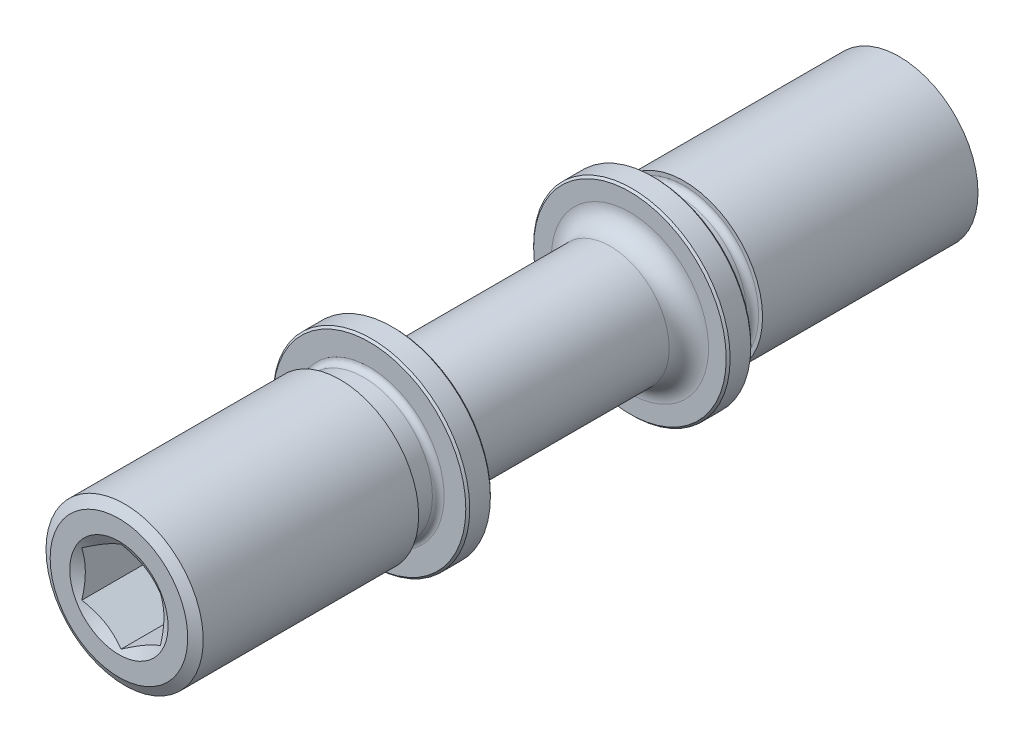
ISO-10303-21;
HEADER;
FILE_DESCRIPTION(('STEP AP214'),'2;1');
FILE_NAME('part.step','',(''),(''),'','','');
FILE_SCHEMA(('AUTOMOTIVE_DESIGN { 1 0 10303 214 1 1 1 1 }'));
ENDSEC;
DATA;
#1=APPLICATION_CONTEXT('core data for automotive mechanical design processes');
#2=APPLICATION_PROTOCOL_DEFINITION('international standard','automotive_design',2000,#1);
#3=PRODUCT_CONTEXT('',#1,'mechanical');
#4=PRODUCT('Part','Part','',(#3));
#5=PRODUCT_RELATED_PRODUCT_CATEGORY('part','',(#4));
#6=PRODUCT_DEFINITION_FORMATION('','',#4);
#7=PRODUCT_DEFINITION_CONTEXT('part definition',#1,'design');
#8=PRODUCT_DEFINITION('design','',#6,#7);
#9=PRODUCT_DEFINITION_SHAPE('','',#8);
#10=(LENGTH_UNIT() NAMED_UNIT(*) SI_UNIT(.MILLI.,.METRE.));
#11=(NAMED_UNIT(*) PLANE_ANGLE_UNIT() SI_UNIT($,.RADIAN.));
#12=(NAMED_UNIT(*) SI_UNIT($,.STERADIAN.) SOLID_ANGLE_UNIT());
#13=UNCERTAINTY_MEASURE_WITH_UNIT(LENGTH_MEASURE(1.E-05),#10,'distance_accuracy_value','');
#14=(GEOMETRIC_REPRESENTATION_CONTEXT(3) GLOBAL_UNCERTAINTY_ASSIGNED_CONTEXT((#13)) GLOBAL_UNIT_ASSIGNED_CONTEXT((#10,
#11,#12)) REPRESENTATION_CONTEXT('',''));
#15=CARTESIAN_POINT('',(0.,0.,0.));
#16=DIRECTION('',(0.,0.,1.));
#17=DIRECTION('',(1.,0.,0.));
#18=AXIS2_PLACEMENT_3D('',#15,#16,#17);
#19=CARTESIAN_POINT('',(0.,0.,40.));
#20=DIRECTION('',(0.,0.,-1.));
#21=DIRECTION('',(-1.,0.,0.));
#22=AXIS2_PLACEMENT_3D('',#19,#20,#21);
#23=PLANE('',#22);
#24=CARTESIAN_POINT('',(0.,0.,40.));
#25=DIRECTION('',(0.,0.,-1.));
#26=DIRECTION('',(-1.,0.,0.));
#27=AXIS2_PLACEMENT_3D('',#24,#25,#26);
#28=CIRCLE('',#27,7.);
#29=CARTESIAN_POINT('',(-7.,0.,40.));
#30=VERTEX_POINT('',#29);
#31=EDGE_CURVE('E98',#30,#30,#28,.F.);
#32=ORIENTED_EDGE('',*,*,#31,.T.);
#33=EDGE_LOOP('',(#32));
#34=FACE_BOUND('',#33,.T.);
#35=CARTESIAN_POINT('',(0.,0.,40.));
#36=DIRECTION('',(0.,0.,-1.));
#37=DIRECTION('',(-1.,0.,0.));
#38=AXIS2_PLACEMENT_3D('',#35,#36,#37);
#39=CIRCLE('',#38,5.);
#40=CARTESIAN_POINT('',(-5.,0.,40.));
#41=VERTEX_POINT('',#40);
#42=EDGE_CURVE('E73',#41,#41,#39,.T.);
#43=ORIENTED_EDGE('',*,*,#42,.T.);
#44=EDGE_LOOP('',(#43));
#45=FACE_BOUND('',#44,.T.);
#46=ADVANCED_FACE('F14',(#34,#45),#23,.F.);
#47=CARTESIAN_POINT('',(0.,6.,12.));
#48=DIRECTION('',(0.,0.,1.));
#49=DIRECTION('',(1.,0.,0.));
#50=AXIS2_PLACEMENT_3D('',#47,#48,#49);
#51=PLANE('',#50);
#52=CARTESIAN_POINT('',(0.,0.,12.));
#53=DIRECTION('',(0.,0.,1.));
#54=DIRECTION('',(1.,0.,0.));
#55=AXIS2_PLACEMENT_3D('',#52,#53,#54);
#56=CIRCLE('',#55,9.8);
#57=CARTESIAN_POINT('',(9.8,0.,12.));
#58=VERTEX_POINT('',#57);
#59=EDGE_CURVE('E9',#58,#58,#56,.F.);
#60=ORIENTED_EDGE('',*,*,#59,.T.);
#61=EDGE_LOOP('',(#60));
#62=FACE_BOUND('',#61,.T.);
#63=CARTESIAN_POINT('',(0.,0.,12.));
#64=DIRECTION('',(0.,0.,1.));
#65=DIRECTION('',(1.,0.,0.));
#66=AXIS2_PLACEMENT_3D('',#63,#64,#65);
#67=CIRCLE('',#66,8.);
#68=CARTESIAN_POINT('',(8.,0.,12.));
#69=VERTEX_POINT('',#68);
#70=EDGE_CURVE('E137',#69,#69,#67,.T.);
#71=ORIENTED_EDGE('',*,*,#70,.T.);
#72=EDGE_LOOP('',(#71));
#73=FACE_BOUND('',#72,.T.);
#74=ADVANCED_FACE('F183',(#62,#73),#51,.F.);
#75=CARTESIAN_POINT('',(0.,0.,40.));
#76=DIRECTION('',(0.,0.,-1.));
#77=DIRECTION('',(-1.,0.,0.));
#78=AXIS2_PLACEMENT_3D('',#75,#76,#77);
#79=CYLINDRICAL_SURFACE('',#78,6.);
#80=CARTESIAN_POINT('',(0.,0.,10.));
#81=DIRECTION('',(0.,0.,1.));
#82=DIRECTION('',(1.,0.,0.));
#83=AXIS2_PLACEMENT_3D('',#80,#81,#82);
#84=CIRCLE('',#83,6.);
#85=CARTESIAN_POINT('',(6.,0.,10.));
#86=VERTEX_POINT('',#85);
#87=EDGE_CURVE('E134',#86,#86,#84,.F.);
#88=ORIENTED_EDGE('',*,*,#87,.T.);
#89=EDGE_LOOP('',(#88));
#90=FACE_BOUND('',#89,.T.);
#91=CARTESIAN_POINT('',(0.,0.,-10.));
#92=DIRECTION('',(0.,0.,-1.));
#93=DIRECTION('',(-1.,0.,0.));
#94=AXIS2_PLACEMENT_3D('',#91,#92,#93);
#95=CIRCLE('',#94,6.);
#96=CARTESIAN_POINT('',(-6.,0.,-10.));
#97=VERTEX_POINT('',#96);
#98=EDGE_CURVE('E131',#97,#97,#95,.F.);
#99=ORIENTED_EDGE('',*,*,#98,.T.);
#100=EDGE_LOOP('',(#99));
#101=FACE_BOUND('',#100,.T.);
#102=ADVANCED_FACE('F186',(#90,#101),#79,.T.);
#103=CARTESIAN_POINT('',(0.,8.,-12.));
#104=DIRECTION('',(0.,0.,-1.));
#105=DIRECTION('',(-1.,0.,0.));
#106=AXIS2_PLACEMENT_3D('',#103,#104,#105);
#107=PLANE('',#106);
#108=CARTESIAN_POINT('',(0.,0.,-12.));
#109=DIRECTION('',(0.,0.,-1.));
#110=DIRECTION('',(-1.,0.,0.));
#111=AXIS2_PLACEMENT_3D('',#108,#109,#110);
#112=CIRCLE('',#111,9.8);
#113=CARTESIAN_POINT('',(-9.8,0.,-12.));
#114=VERTEX_POINT('',#113);
#115=EDGE_CURVE('E152',#114,#114,#112,.F.);
#116=ORIENTED_EDGE('',*,*,#115,.T.);
#117=EDGE_LOOP('',(#116));
#118=FACE_BOUND('',#117,.T.);
#119=CARTESIAN_POINT('',(0.,0.,-12.));
#120=DIRECTION('',(0.,0.,-1.));
#121=DIRECTION('',(-1.,0.,0.));
#122=AXIS2_PLACEMENT_3D('',#119,#120,#121);
#123=CIRCLE('',#122,8.);
#124=CARTESIAN_POINT('',(-8.,0.,-12.));
#125=VERTEX_POINT('',#124);
#126=EDGE_CURVE('E140',#125,#125,#123,.T.);
#127=ORIENTED_EDGE('',*,*,#126,.T.);
#128=EDGE_LOOP('',(#127));
#129=FACE_BOUND('',#128,.T.);
#130=ADVANCED_FACE('F175',(#118,#129),#107,.F.);
#131=CARTESIAN_POINT('',(0.,0.,40.));
#132=DIRECTION('',(0.,0.,-1.));
#133=DIRECTION('',(-1.,0.,0.));
#134=AXIS2_PLACEMENT_3D('',#131,#132,#133);
#135=CYLINDRICAL_SURFACE('',#134,10.);
#136=CARTESIAN_POINT('',(0.,0.,14.3));
#137=DIRECTION('',(0.,0.,-1.));
#138=DIRECTION('',(-1.,0.,0.));
#139=AXIS2_PLACEMENT_3D('',#136,#137,#138);
#140=CIRCLE('',#139,10.);
#141=CARTESIAN_POINT('',(-10.,0.,14.3));
#142=VERTEX_POINT('',#141);
#143=EDGE_CURVE('E158',#142,#142,#140,.T.);
#144=ORIENTED_EDGE('',*,*,#143,.T.);
#145=EDGE_LOOP('',(#144));
#146=FACE_BOUND('',#145,.T.);
#147=CARTESIAN_POINT('',(0.,0.,12.2));
#148=DIRECTION('',(0.,0.,1.));
#149=DIRECTION('',(1.,0.,0.));
#150=AXIS2_PLACEMENT_3D('',#147,#148,#149);
#151=CIRCLE('',#150,10.);
#152=CARTESIAN_POINT('',(10.,0.,12.2));
#153=VERTEX_POINT('',#152);
#154=EDGE_CURVE('E155',#153,#153,#151,.T.);
#155=ORIENTED_EDGE('',*,*,#154,.T.);
#156=EDGE_LOOP('',(#155));
#157=FACE_BOUND('',#156,.T.);
#158=ADVANCED_FACE('F172',(#146,#157),#135,.T.);
#159=CARTESIAN_POINT('',(0.,8.,14.5));
#160=DIRECTION('',(0.,0.,-1.));
#161=DIRECTION('',(-1.,0.,0.));
#162=AXIS2_PLACEMENT_3D('',#159,#160,#161);
#163=PLANE('',#162);
#164=CARTESIAN_POINT('',(0.,0.,14.5));
#165=DIRECTION('',(0.,0.,-1.));
#166=DIRECTION('',(-1.,0.,0.));
#167=AXIS2_PLACEMENT_3D('',#164,#165,#166);
#168=CIRCLE('',#167,9.8);
#169=CARTESIAN_POINT('',(-9.8,0.,14.5));
#170=VERTEX_POINT('',#169);
#171=EDGE_CURVE('E22',#170,#170,#168,.F.);
#172=ORIENTED_EDGE('',*,*,#171,.T.);
#173=EDGE_LOOP('',(#172));
#174=FACE_BOUND('',#173,.T.);
#175=CARTESIAN_POINT('',(0.,0.,14.5));
#176=DIRECTION('',(0.,0.,-1.));
#177=DIRECTION('',(-1.,0.,0.));
#178=AXIS2_PLACEMENT_3D('',#175,#176,#177);
#179=CIRCLE('',#178,7.6);
#180=CARTESIAN_POINT('',(-7.6,0.,14.5));
#181=VERTEX_POINT('',#180);
#182=EDGE_CURVE('E116',#181,#181,#179,.T.);
#183=ORIENTED_EDGE('',*,*,#182,.T.);
#184=EDGE_LOOP('',(#183));
#185=FACE_BOUND('',#184,.T.);
#186=ADVANCED_FACE('F163',(#174,#185),#163,.F.);
#187=CARTESIAN_POINT('',(0.,0.,40.));
#188=DIRECTION('',(0.,0.,-1.));
#189=DIRECTION('',(-1.,0.,0.));
#190=AXIS2_PLACEMENT_3D('',#187,#188,#189);
#191=CYLINDRICAL_SURFACE('',#190,10.);
#192=CARTESIAN_POINT('',(0.,0.,-14.3));
#193=DIRECTION('',(0.,0.,1.));
#194=DIRECTION('',(1.,0.,0.));
#195=AXIS2_PLACEMENT_3D('',#192,#193,#194);
#196=CIRCLE('',#195,10.);
#197=CARTESIAN_POINT('',(10.,0.,-14.3));
#198=VERTEX_POINT('',#197);
#199=EDGE_CURVE('E149',#198,#198,#196,.T.);
#200=ORIENTED_EDGE('',*,*,#199,.T.);
#201=EDGE_LOOP('',(#200));
#202=FACE_BOUND('',#201,.T.);
#203=CARTESIAN_POINT('',(0.,0.,-12.2));
#204=DIRECTION('',(0.,0.,-1.));
#205=DIRECTION('',(-1.,0.,0.));
#206=AXIS2_PLACEMENT_3D('',#203,#204,#205);
#207=CIRCLE('',#206,10.);
#208=CARTESIAN_POINT('',(-10.,0.,-12.2));
#209=VERTEX_POINT('',#208);
#210=EDGE_CURVE('E146',#209,#209,#207,.T.);
#211=ORIENTED_EDGE('',*,*,#210,.T.);
#212=EDGE_LOOP('',(#211));
#213=FACE_BOUND('',#212,.T.);
#214=ADVANCED_FACE('F265',(#202,#213),#191,.T.);
#215=CARTESIAN_POINT('',(0.,8.,-14.5));
#216=DIRECTION('',(0.,0.,1.));
#217=DIRECTION('',(1.,0.,0.));
#218=AXIS2_PLACEMENT_3D('',#215,#216,#217);
#219=PLANE('',#218);
#220=CARTESIAN_POINT('',(0.,0.,-14.5));
#221=DIRECTION('',(0.,0.,1.));
#222=DIRECTION('',(1.,0.,0.));
#223=AXIS2_PLACEMENT_3D('',#220,#221,#222);
#224=CIRCLE('',#223,9.8);
#225=CARTESIAN_POINT('',(9.8,0.,-14.5));
#226=VERTEX_POINT('',#225);
#227=EDGE_CURVE('E143',#226,#226,#224,.F.);
#228=ORIENTED_EDGE('',*,*,#227,.T.);
#229=EDGE_LOOP('',(#228));
#230=FACE_BOUND('',#229,.T.);
#231=CARTESIAN_POINT('',(0.,0.,-14.5));
#232=DIRECTION('',(0.,0.,1.));
#233=DIRECTION('',(1.,0.,0.));
#234=AXIS2_PLACEMENT_3D('',#231,#232,#233);
#235=CIRCLE('',#234,7.6);
#236=CARTESIAN_POINT('',(7.6,0.,-14.5));
#237=VERTEX_POINT('',#236);
#238=EDGE_CURVE('E119',#237,#237,#235,.T.);
#239=ORIENTED_EDGE('',*,*,#238,.T.);
#240=EDGE_LOOP('',(#239));
#241=FACE_BOUND('',#240,.T.);
#242=ADVANCED_FACE('F267',(#230,#241),#219,.F.);
#243=CARTESIAN_POINT('',(0.,0.,40.));
#244=DIRECTION('',(0.,0.,1.));
#245=DIRECTION('',(1.,0.,0.));
#246=AXIS2_PLACEMENT_3D('',#243,#244,#245);
#247=CYLINDRICAL_SURFACE('',#246,7.);
#248=CARTESIAN_POINT('',(0.,0.,16.9));
#249=DIRECTION('',(0.,0.,1.));
#250=DIRECTION('',(1.,0.,0.));
#251=AXIS2_PLACEMENT_3D('',#248,#249,#250);
#252=CIRCLE('',#251,7.);
#253=CARTESIAN_POINT('',(7.,0.,16.9));
#254=VERTEX_POINT('',#253);
#255=EDGE_CURVE('E113',#254,#254,#252,.F.);
#256=ORIENTED_EDGE('',*,*,#255,.T.);
#257=EDGE_LOOP('',(#256));
#258=FACE_BOUND('',#257,.T.);
#259=CARTESIAN_POINT('',(0.,0.,15.1));
#260=DIRECTION('',(0.,0.,-1.));
#261=DIRECTION('',(-1.,0.,0.));
#262=AXIS2_PLACEMENT_3D('',#259,#260,#261);
#263=CIRCLE('',#262,7.);
#264=CARTESIAN_POINT('',(-7.,0.,15.1));
#265=VERTEX_POINT('',#264);
#266=EDGE_CURVE('E110',#265,#265,#263,.F.);
#267=ORIENTED_EDGE('',*,*,#266,.T.);
#268=EDGE_LOOP('',(#267));
#269=FACE_BOUND('',#268,.T.);
#270=ADVANCED_FACE('F275',(#258,#269),#247,.T.);
#271=CARTESIAN_POINT('',(0.,8.,17.5));
#272=DIRECTION('',(0.,0.,1.));
#273=DIRECTION('',(1.,0.,0.));
#274=AXIS2_PLACEMENT_3D('',#271,#272,#273);
#275=PLANE('',#274);
#276=CARTESIAN_POINT('',(0.,0.,17.5));
#277=DIRECTION('',(0.,0.,1.));
#278=DIRECTION('',(1.,0.,0.));
#279=AXIS2_PLACEMENT_3D('',#276,#277,#278);
#280=CIRCLE('',#279,7.6);
#281=CARTESIAN_POINT('',(7.6,0.,17.5));
#282=VERTEX_POINT('',#281);
#283=EDGE_CURVE('E107',#282,#282,#280,.T.);
#284=ORIENTED_EDGE('',*,*,#283,.T.);
#285=EDGE_LOOP('',(#284));
#286=FACE_BOUND('',#285,.T.);
#287=CARTESIAN_POINT('',(0.,0.,17.5));
#288=DIRECTION('',(0.,0.,1.));
#289=DIRECTION('',(1.,0.,0.));
#290=AXIS2_PLACEMENT_3D('',#287,#288,#289);
#291=CIRCLE('',#290,8.);
#292=CARTESIAN_POINT('',(8.,0.,17.5));
#293=VERTEX_POINT('',#292);
#294=EDGE_CURVE('E367',#293,#293,#291,.T.);
#295=ORIENTED_EDGE('',*,*,#294,.F.);
#296=EDGE_LOOP('',(#295));
#297=FACE_BOUND('',#296,.T.);
#298=ADVANCED_FACE('F230',(#286,#297),#275,.F.);
#299=CARTESIAN_POINT('',(0.,0.,39.4226497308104));
#300=DIRECTION('',(0.,0.,-1.));
#301=DIRECTION('',(-1.,0.,0.));
#302=AXIS2_PLACEMENT_3D('',#299,#300,#301);
#303=CONICAL_SURFACE('',#302,8.,1.0471975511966);
#304=ORIENTED_EDGE('',*,*,#31,.F.);
#305=EDGE_LOOP('',(#304));
#306=FACE_BOUND('',#305,.T.);
#307=CARTESIAN_POINT('',(0.,0.,39.4226497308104));
#308=DIRECTION('',(0.,0.,-1.));
#309=DIRECTION('',(-1.,0.,0.));
#310=AXIS2_PLACEMENT_3D('',#307,#308,#309);
#311=CIRCLE('',#310,8.);
#312=CARTESIAN_POINT('',(-8.,0.,39.4226497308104));
#313=VERTEX_POINT('',#312);
#314=EDGE_CURVE('E95',#313,#313,#311,.T.);
#315=ORIENTED_EDGE('',*,*,#314,.F.);
#316=EDGE_LOOP('',(#315));
#317=FACE_BOUND('',#316,.T.);
#318=ADVANCED_FACE('F227',(#306,#317),#303,.T.);
#319=CARTESIAN_POINT('',(0.,0.,40.));
#320=DIRECTION('',(0.,0.,-1.));
#321=DIRECTION('',(-1.,0.,0.));
#322=AXIS2_PLACEMENT_3D('',#319,#320,#321);
#323=CYLINDRICAL_SURFACE('',#322,8.);
#324=ORIENTED_EDGE('',*,*,#294,.T.);
#325=EDGE_LOOP('',(#324));
#326=FACE_BOUND('',#325,.T.);
#327=ORIENTED_EDGE('',*,*,#314,.T.);
#328=EDGE_LOOP('',(#327));
#329=FACE_BOUND('',#328,.T.);
#330=ADVANCED_FACE('F226',(#326,#329),#323,.T.);
#331=CARTESIAN_POINT('',(0.,0.,40.));
#332=DIRECTION('',(0.,0.,1.));
#333=DIRECTION('',(1.,0.,0.));
#334=AXIS2_PLACEMENT_3D('',#331,#332,#333);
#335=CYLINDRICAL_SURFACE('',#334,7.);
#336=CARTESIAN_POINT('',(0.,0.,-15.1));
#337=DIRECTION('',(0.,0.,1.));
#338=DIRECTION('',(1.,0.,0.));
#339=AXIS2_PLACEMENT_3D('',#336,#337,#338);
#340=CIRCLE('',#339,7.);
#341=CARTESIAN_POINT('',(7.,0.,-15.1));
#342=VERTEX_POINT('',#341);
#343=EDGE_CURVE('E125',#342,#342,#340,.F.);
#344=ORIENTED_EDGE('',*,*,#343,.T.);
#345=EDGE_LOOP('',(#344));
#346=FACE_BOUND('',#345,.T.);
#347=CARTESIAN_POINT('',(0.,0.,-16.9));
#348=DIRECTION('',(0.,0.,-1.));
#349=DIRECTION('',(-1.,0.,0.));
#350=AXIS2_PLACEMENT_3D('',#347,#348,#349);
#351=CIRCLE('',#350,7.);
#352=CARTESIAN_POINT('',(-7.,0.,-16.9));
#353=VERTEX_POINT('',#352);
#354=EDGE_CURVE('E122',#353,#353,#351,.F.);
#355=ORIENTED_EDGE('',*,*,#354,.T.);
#356=EDGE_LOOP('',(#355));
#357=FACE_BOUND('',#356,.T.);
#358=ADVANCED_FACE('F546',(#346,#357),#335,.T.);
#359=CARTESIAN_POINT('',(0.,8.,-17.5));
#360=DIRECTION('',(0.,0.,-1.));
#361=DIRECTION('',(-1.,0.,0.));
#362=AXIS2_PLACEMENT_3D('',#359,#360,#361);
#363=PLANE('',#362);
#364=CARTESIAN_POINT('',(0.,0.,-17.5));
#365=DIRECTION('',(0.,0.,-1.));
#366=DIRECTION('',(-1.,0.,0.));
#367=AXIS2_PLACEMENT_3D('',#364,#365,#366);
#368=CIRCLE('',#367,7.6);
#369=CARTESIAN_POINT('',(-7.6,0.,-17.5));
#370=VERTEX_POINT('',#369);
#371=EDGE_CURVE('E128',#370,#370,#368,.T.);
#372=ORIENTED_EDGE('',*,*,#371,.T.);
#373=EDGE_LOOP('',(#372));
#374=FACE_BOUND('',#373,.T.);
#375=CARTESIAN_POINT('',(0.,0.,-17.5));
#376=DIRECTION('',(0.,0.,1.));
#377=DIRECTION('',(1.,0.,0.));
#378=AXIS2_PLACEMENT_3D('',#375,#376,#377);
#379=CIRCLE('',#378,8.);
#380=CARTESIAN_POINT('',(8.,0.,-17.5));
#381=VERTEX_POINT('',#380);
#382=EDGE_CURVE('E362',#381,#381,#379,.T.);
#383=ORIENTED_EDGE('',*,*,#382,.T.);
#384=EDGE_LOOP('',(#383));
#385=FACE_BOUND('',#384,.T.);
#386=ADVANCED_FACE('F314',(#374,#385),#363,.F.);
#387=CARTESIAN_POINT('',(0.,0.,-40.));
#388=DIRECTION('',(0.,0.,1.));
#389=DIRECTION('',(1.,0.,0.));
#390=AXIS2_PLACEMENT_3D('',#387,#388,#389);
#391=PLANE('',#390);
#392=CARTESIAN_POINT('',(0.,0.,-40.));
#393=DIRECTION('',(0.,0.,1.));
#394=DIRECTION('',(1.,0.,0.));
#395=AXIS2_PLACEMENT_3D('',#392,#393,#394);
#396=CIRCLE('',#395,7.);
#397=CARTESIAN_POINT('',(7.,0.,-40.));
#398=VERTEX_POINT('',#397);
#399=EDGE_CURVE('E101',#398,#398,#396,.F.);
#400=ORIENTED_EDGE('',*,*,#399,.T.);
#401=EDGE_LOOP('',(#400));
#402=FACE_BOUND('',#401,.T.);
#403=ADVANCED_FACE('F236',(#402),#391,.F.);
#404=CARTESIAN_POINT('',(0.,0.,-40.));
#405=DIRECTION('',(0.,0.,1.));
#406=DIRECTION('',(1.,0.,0.));
#407=AXIS2_PLACEMENT_3D('',#404,#405,#406);
#408=CONICAL_SURFACE('',#407,7.,1.04719755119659);
#409=CARTESIAN_POINT('',(0.,0.,-39.4226497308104));
#410=DIRECTION('',(0.,0.,1.));
#411=DIRECTION('',(1.,0.,0.));
#412=AXIS2_PLACEMENT_3D('',#409,#410,#411);
#413=CIRCLE('',#412,8.);
#414=CARTESIAN_POINT('',(8.,0.,-39.4226497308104));
#415=VERTEX_POINT('',#414);
#416=EDGE_CURVE('E104',#415,#415,#413,.T.);
#417=ORIENTED_EDGE('',*,*,#416,.F.);
#418=EDGE_LOOP('',(#417));
#419=FACE_BOUND('',#418,.T.);
#420=ORIENTED_EDGE('',*,*,#399,.F.);
#421=EDGE_LOOP('',(#420));
#422=FACE_BOUND('',#421,.T.);
#423=ADVANCED_FACE('F232',(#419,#422),#408,.T.);
#424=CARTESIAN_POINT('',(0.,0.,40.));
#425=DIRECTION('',(0.,0.,-1.));
#426=DIRECTION('',(-1.,0.,0.));
#427=AXIS2_PLACEMENT_3D('',#424,#425,#426);
#428=CYLINDRICAL_SURFACE('',#427,8.);
#429=ORIENTED_EDGE('',*,*,#382,.F.);
#430=EDGE_LOOP('',(#429));
#431=FACE_BOUND('',#430,.T.);
#432=ORIENTED_EDGE('',*,*,#416,.T.);
#433=EDGE_LOOP('',(#432));
#434=FACE_BOUND('',#433,.T.);
#435=ADVANCED_FACE('F235',(#431,#434),#428,.T.);
#436=CARTESIAN_POINT('',(0.,0.,16.9));
#437=DIRECTION('',(0.,0.,1.));
#438=DIRECTION('',(1.,0.,0.));
#439=AXIS2_PLACEMENT_3D('',#436,#437,#438);
#440=TOROIDAL_SURFACE('',#439,7.6,0.6);
#441=ORIENTED_EDGE('',*,*,#255,.F.);
#442=EDGE_LOOP('',(#441));
#443=FACE_BOUND('',#442,.T.);
#444=ORIENTED_EDGE('',*,*,#283,.F.);
#445=EDGE_LOOP('',(#444));
#446=FACE_BOUND('',#445,.T.);
#447=ADVANCED_FACE('F238',(#443,#446),#440,.F.);
#448=CARTESIAN_POINT('',(0.,0.,15.1));
#449=DIRECTION('',(0.,0.,-1.));
#450=DIRECTION('',(-1.,0.,0.));
#451=AXIS2_PLACEMENT_3D('',#448,#449,#450);
#452=TOROIDAL_SURFACE('',#451,7.6,0.6);
#453=ORIENTED_EDGE('',*,*,#182,.F.);
#454=EDGE_LOOP('',(#453));
#455=FACE_BOUND('',#454,.T.);
#456=ORIENTED_EDGE('',*,*,#266,.F.);
#457=EDGE_LOOP('',(#456));
#458=FACE_BOUND('',#457,.T.);
#459=ADVANCED_FACE('F241',(#455,#458),#452,.F.);
#460=CARTESIAN_POINT('',(0.,0.,-15.1));
#461=DIRECTION('',(0.,0.,1.));
#462=DIRECTION('',(1.,0.,0.));
#463=AXIS2_PLACEMENT_3D('',#460,#461,#462);
#464=TOROIDAL_SURFACE('',#463,7.6,0.6);
#465=ORIENTED_EDGE('',*,*,#343,.F.);
#466=EDGE_LOOP('',(#465));
#467=FACE_BOUND('',#466,.T.);
#468=ORIENTED_EDGE('',*,*,#238,.F.);
#469=EDGE_LOOP('',(#468));
#470=FACE_BOUND('',#469,.T.);
#471=ADVANCED_FACE('F245',(#467,#470),#464,.F.);
#472=CARTESIAN_POINT('',(0.,0.,-16.9));
#473=DIRECTION('',(0.,0.,-1.));
#474=DIRECTION('',(-1.,0.,0.));
#475=AXIS2_PLACEMENT_3D('',#472,#473,#474);
#476=TOROIDAL_SURFACE('',#475,7.6,0.6);
#477=ORIENTED_EDGE('',*,*,#371,.F.);
#478=EDGE_LOOP('',(#477));
#479=FACE_BOUND('',#478,.T.);
#480=ORIENTED_EDGE('',*,*,#354,.F.);
#481=EDGE_LOOP('',(#480));
#482=FACE_BOUND('',#481,.T.);
#483=ADVANCED_FACE('F194',(#479,#482),#476,.F.);
#484=CARTESIAN_POINT('',(0.,0.,10.));
#485=DIRECTION('',(0.,0.,1.));
#486=DIRECTION('',(1.,0.,0.));
#487=AXIS2_PLACEMENT_3D('',#484,#485,#486);
#488=TOROIDAL_SURFACE('',#487,8.,2.);
#489=ORIENTED_EDGE('',*,*,#70,.F.);
#490=EDGE_LOOP('',(#489));
#491=FACE_BOUND('',#490,.T.);
#492=ORIENTED_EDGE('',*,*,#87,.F.);
#493=EDGE_LOOP('',(#492));
#494=FACE_BOUND('',#493,.T.);
#495=ADVANCED_FACE('F190',(#491,#494),#488,.F.);
#496=CARTESIAN_POINT('',(0.,0.,-10.));
#497=DIRECTION('',(0.,0.,-1.));
#498=DIRECTION('',(-1.,0.,0.));
#499=AXIS2_PLACEMENT_3D('',#496,#497,#498);
#500=TOROIDAL_SURFACE('',#499,8.,2.);
#501=ORIENTED_EDGE('',*,*,#98,.F.);
#502=EDGE_LOOP('',(#501));
#503=FACE_BOUND('',#502,.T.);
#504=ORIENTED_EDGE('',*,*,#126,.F.);
#505=EDGE_LOOP('',(#504));
#506=FACE_BOUND('',#505,.T.);
#507=ADVANCED_FACE('F193',(#503,#506),#500,.F.);
#508=CARTESIAN_POINT('',(0.,0.,-14.5));
#509=DIRECTION('',(0.,0.,1.));
#510=DIRECTION('',(1.,0.,0.));
#511=AXIS2_PLACEMENT_3D('',#508,#509,#510);
#512=CONICAL_SURFACE('',#511,9.8,0.785398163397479);
#513=ORIENTED_EDGE('',*,*,#199,.F.);
#514=EDGE_LOOP('',(#513));
#515=FACE_BOUND('',#514,.T.);
#516=ORIENTED_EDGE('',*,*,#227,.F.);
#517=EDGE_LOOP('',(#516));
#518=FACE_BOUND('',#517,.T.);
#519=ADVANCED_FACE('F205',(#515,#518),#512,.T.);
#520=CARTESIAN_POINT('',(0.,0.,-12.2));
#521=DIRECTION('',(0.,0.,-1.));
#522=DIRECTION('',(-1.,0.,0.));
#523=AXIS2_PLACEMENT_3D('',#520,#521,#522);
#524=CONICAL_SURFACE('',#523,10.,0.785398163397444);
#525=ORIENTED_EDGE('',*,*,#115,.F.);
#526=EDGE_LOOP('',(#525));
#527=FACE_BOUND('',#526,.T.);
#528=ORIENTED_EDGE('',*,*,#210,.F.);
#529=EDGE_LOOP('',(#528));
#530=FACE_BOUND('',#529,.T.);
#531=ADVANCED_FACE('F169',(#527,#530),#524,.T.);
#532=CARTESIAN_POINT('',(0.,0.,14.3));
#533=DIRECTION('',(0.,0.,-1.));
#534=DIRECTION('',(-1.,0.,0.));
#535=AXIS2_PLACEMENT_3D('',#532,#533,#534);
#536=CONICAL_SURFACE('',#535,10.,0.785398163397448);
#537=ORIENTED_EDGE('',*,*,#171,.F.);
#538=EDGE_LOOP('',(#537));
#539=FACE_BOUND('',#538,.T.);
#540=ORIENTED_EDGE('',*,*,#143,.F.);
#541=EDGE_LOOP('',(#540));
#542=FACE_BOUND('',#541,.T.);
#543=ADVANCED_FACE('F166',(#539,#542),#536,.T.);
#544=CARTESIAN_POINT('',(0.,0.,12.));
#545=DIRECTION('',(0.,0.,1.));
#546=DIRECTION('',(1.,0.,0.));
#547=AXIS2_PLACEMENT_3D('',#544,#545,#546);
#548=CONICAL_SURFACE('',#547,9.8,0.785398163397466);
#549=ORIENTED_EDGE('',*,*,#154,.F.);
#550=EDGE_LOOP('',(#549));
#551=FACE_BOUND('',#550,.T.);
#552=ORIENTED_EDGE('',*,*,#59,.F.);
#553=EDGE_LOOP('',(#552));
#554=FACE_BOUND('',#553,.T.);
#555=ADVANCED_FACE('F16',(#551,#554),#548,.T.);
#556=CARTESIAN_POINT('',(0.,0.,40.));
#557=DIRECTION('',(0.,0.,1.));
#558=DIRECTION('',(1.,0.,0.));
#559=AXIS2_PLACEMENT_3D('',#556,#557,#558);
#560=CONICAL_SURFACE('',#559,5.,1.0471975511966);
#561=ORIENTED_EDGE('',*,*,#42,.F.);
#562=EDGE_LOOP('',(#561));
#563=FACE_BOUND('',#562,.T.);
#564=CARTESIAN_POINT('',(-4.,-6.08296069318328,41.3165176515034));
#565=CARTESIAN_POINT('',(-4.,-5.90920488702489,41.2327219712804));
#566=CARTESIAN_POINT('',(-4.,-5.73503696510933,41.14976549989));
#567=CARTESIAN_POINT('',(-4.,-5.38565718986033,40.9860056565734));
#568=CARTESIAN_POINT('',(-4.,-5.21044516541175,40.905202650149));
#569=CARTESIAN_POINT('',(-4.,-4.85779568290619,40.7457918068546));
#570=CARTESIAN_POINT('',(-4.,-4.68035121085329,40.6671994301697));
#571=CARTESIAN_POINT('',(-4.,-4.32400778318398,40.5133969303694));
#572=CARTESIAN_POINT('',(-4.,-4.14510890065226,40.4381866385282));
#573=CARTESIAN_POINT('',(-4.,-3.7803285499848,40.2899141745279));
#574=CARTESIAN_POINT('',(-4.,-3.59439544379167,40.2169783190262));
#575=CARTESIAN_POINT('',(-4.,-3.22031004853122,40.0769240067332));
#576=CARTESIAN_POINT('',(-4.,-3.03215750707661,40.0098062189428));
#577=CARTESIAN_POINT('',(-4.,-2.6537267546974,39.8832385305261));
#578=CARTESIAN_POINT('',(-4.,-2.46345416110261,39.8237720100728));
#579=CARTESIAN_POINT('',(-4.,-2.08018387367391,39.7144935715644));
#580=CARTESIAN_POINT('',(-4.,-1.88718709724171,39.6646784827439));
#581=CARTESIAN_POINT('',(-4.,-1.4993819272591,39.5774227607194));
#582=CARTESIAN_POINT('',(-4.,-1.30458749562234,39.5399212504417));
#583=CARTESIAN_POINT('',(-4.,-0.912708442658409,39.4795014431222));
#584=CARTESIAN_POINT('',(-4.,-0.715624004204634,39.4565819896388));
#585=CARTESIAN_POINT('',(-4.,-0.322670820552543,39.42745577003));
#586=CARTESIAN_POINT('',(-4.,-0.126817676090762,39.4210436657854));
#587=CARTESIAN_POINT('',(-4.,0.264734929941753,39.4249421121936));
#588=CARTESIAN_POINT('',(-4.,0.460434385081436,39.4352533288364));
#589=CARTESIAN_POINT('',(-4.,0.796334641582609,39.4665942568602));
#590=CARTESIAN_POINT('',(-4.,0.936904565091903,39.483867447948));
#591=CARTESIAN_POINT('',(-4.,1.21692877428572,39.5258992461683));
#592=CARTESIAN_POINT('',(-4.,1.3563828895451,39.550658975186));
#593=CARTESIAN_POINT('',(-4.,1.77293270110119,39.6348571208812));
#594=CARTESIAN_POINT('',(-4.,2.0480447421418,39.7041965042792));
#595=CARTESIAN_POINT('',(-4.,2.45933211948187,39.8233438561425));
#596=CARTESIAN_POINT('',(-4.,2.59766384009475,39.8661227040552));
#597=CARTESIAN_POINT('',(-4.,2.87298203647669,39.9558479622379));
#598=CARTESIAN_POINT('',(-4.,3.00996850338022,40.0027943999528));
#599=CARTESIAN_POINT('',(-4.,3.28264563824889,40.1001245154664));
#600=CARTESIAN_POINT('',(-4.,3.41833677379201,40.1505068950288));
#601=CARTESIAN_POINT('',(-4.,3.68861302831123,40.2541437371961));
#602=CARTESIAN_POINT('',(-4.,3.82319815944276,40.3073981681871));
#603=CARTESIAN_POINT('',(-4.,4.13794886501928,40.435201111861));
#604=CARTESIAN_POINT('',(-4.,4.31771809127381,40.510723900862));
#605=CARTESIAN_POINT('',(-4.,4.67578559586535,40.6651884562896));
#606=CARTESIAN_POINT('',(-4.,4.85408379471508,40.7441304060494));
#607=CARTESIAN_POINT('',(-4.,5.20947972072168,40.9047499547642));
#608=CARTESIAN_POINT('',(-4.,5.38657722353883,40.986428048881));
#609=CARTESIAN_POINT('',(-4.,5.73974410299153,41.1519806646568));
#610=CARTESIAN_POINT('',(-4.,5.91581345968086,41.2358552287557));
#611=CARTESIAN_POINT('',(-4.,6.4430572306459,41.4902920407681));
#612=CARTESIAN_POINT('',(-4.,6.7929446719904,41.6635196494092));
#613=CARTESIAN_POINT('',(-4.,7.49028882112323,42.0147986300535));
#614=CARTESIAN_POINT('',(-4.,7.83774544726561,42.1928501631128));
#615=CARTESIAN_POINT('',(-4.,8.50249018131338,42.5376644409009));
#616=CARTESIAN_POINT('',(-4.,8.81991846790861,42.7041574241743));
#617=CARTESIAN_POINT('',(-4.,9.45363341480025,43.0393229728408));
#618=CARTESIAN_POINT('',(-4.,9.76992003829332,43.2079956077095));
#619=CARTESIAN_POINT('',(-4.,10.400881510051,43.5466198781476));
#620=CARTESIAN_POINT('',(-4.,10.7155583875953,43.7165677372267));
#621=CARTESIAN_POINT('',(-4.,11.3441815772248,44.0577722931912));
#622=CARTESIAN_POINT('',(-4.,11.658127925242,44.229028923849));
#623=CARTESIAN_POINT('',(-4.,11.9718046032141,44.4007746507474));
#624=B_SPLINE_CURVE_WITH_KNOTS('',3,(#564,#565,#566,#567,#568,#569,#570,#571,#572,#573,#574,
#575,#576,#577,#578,#579,#580,#581,#582,#583,#584,#585,#586,#587,#588,#589,#590,#591,#592,#593,
#594,#595,#596,#597,#598,#599,#600,#601,#602,#603,#604,#605,#606,#607,#608,#609,#610,#611,#612,
#613,#614,#615,#616,#617,#618,#619,#620,#621,#622,#623),.UNSPECIFIED.,.F.,.F.,(4,2,2,2,2,2,2,2,
2,2,2,2,2,2,2,2,2,2,2,2,2,2,2,2,2,2,2,2,2,4),(0.,0.57872624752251,1.15755010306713,
1.7397329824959,2.32188678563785,2.92099174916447,3.52016551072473,4.11801496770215,
4.71566768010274,5.31031953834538,5.9049242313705,6.49209597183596,7.07929109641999,
7.50396442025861,7.92870141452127,8.77868928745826,9.21304224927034,9.64739807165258,
10.0815906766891,10.5157785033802,11.1006975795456,11.6856480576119,12.270704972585,
12.8557732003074,14.0269741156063,15.1982141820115,16.2735288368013,17.3488778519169,
18.4217837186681,19.4946356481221),.UNSPECIFIED.);
#625=CARTESIAN_POINT('',(-4.,-2.30940107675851,39.7799153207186));
#626=VERTEX_POINT('',#625);
#627=CARTESIAN_POINT('',(-4.,2.30940107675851,39.7799153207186));
#628=VERTEX_POINT('',#627);
#629=EDGE_CURVE('E29',#626,#628,#624,.T.);
#630=ORIENTED_EDGE('',*,*,#629,.T.);
#631=CARTESIAN_POINT('',(-4.0002,2.30928560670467,39.7799819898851));
#632=CARTESIAN_POINT('',(-3.82442084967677,2.41077174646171,39.7213676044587));
#633=CARTESIAN_POINT('',(-3.64712438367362,2.513133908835,39.6680600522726));
#634=CARTESIAN_POINT('',(-3.28946140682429,2.71963072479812,39.5750114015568));
#635=CARTESIAN_POINT('',(-3.10908854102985,2.82376904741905,39.5353032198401));
#636=CARTESIAN_POINT('',(-2.75057818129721,3.03075510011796,39.4734919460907));
#637=CARTESIAN_POINT('',(-2.57249584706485,3.13357098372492,39.4509774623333));
#638=CARTESIAN_POINT('',(-2.21549328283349,3.33968651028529,39.424100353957));
#639=CARTESIAN_POINT('',(-2.03657435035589,3.44298540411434,39.4197154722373));
#640=CARTESIAN_POINT('',(-1.70225715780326,3.63600352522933,39.4288398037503));
#641=CARTESIAN_POINT('',(-1.54680884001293,3.72575165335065,39.4401086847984));
#642=CARTESIAN_POINT('',(-1.23692494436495,3.90466320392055,39.4758237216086));
#643=CARTESIAN_POINT('',(-1.08249043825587,3.99382600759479,39.5002820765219));
#644=CARTESIAN_POINT('',(-0.771967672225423,4.17310641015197,39.5614257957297));
#645=CARTESIAN_POINT('',(-0.615918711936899,4.26320131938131,39.5983703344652));
#646=CARTESIAN_POINT('',(-0.306148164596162,4.44204742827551,39.6822198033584));
#647=CARTESIAN_POINT('',(-0.152422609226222,4.53080091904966,39.7291050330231));
#648=CARTESIAN_POINT('',(0.00020000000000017,4.61891762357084,39.7799819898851));
#649=B_SPLINE_CURVE_WITH_KNOTS('',3,(#631,#632,#633,#634,#635,#636,#637,#638,#639,#640,#641,
#642,#643,#644,#645,#646,#647,#648),.UNSPECIFIED.,.F.,.F.,(4,2,2,2,2,2,2,2,4),(0.,
0.634047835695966,1.26961969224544,1.88946157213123,2.50854226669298,3.04757825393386,
3.58711366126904,4.13861653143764,4.68903648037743),.UNSPECIFIED.);
#650=CARTESIAN_POINT('',(0.,4.61880215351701,39.7799153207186));
#651=VERTEX_POINT('',#650);
#652=EDGE_CURVE('E64',#628,#651,#649,.T.);
#653=ORIENTED_EDGE('',*,*,#652,.T.);
#654=CARTESIAN_POINT('',(-0.000200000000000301,4.61891762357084,39.7799819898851));
#655=CARTESIAN_POINT('',(0.175579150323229,4.5174314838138,39.7213676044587));
#656=CARTESIAN_POINT('',(0.352875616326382,4.41506932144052,39.6680600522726));
#657=CARTESIAN_POINT('',(0.71053859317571,4.20857250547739,39.5750114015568));
#658=CARTESIAN_POINT('',(0.890911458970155,4.10443418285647,39.5353032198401));
#659=CARTESIAN_POINT('',(1.2494218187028,3.89744813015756,39.4734919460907));
#660=CARTESIAN_POINT('',(1.42750415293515,3.79463224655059,39.4509774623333));
#661=CARTESIAN_POINT('',(1.78450671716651,3.58851671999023,39.424100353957));
#662=CARTESIAN_POINT('',(1.96342564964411,3.48521782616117,39.4197154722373));
#663=CARTESIAN_POINT('',(2.29774284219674,3.29219970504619,39.4288398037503));
#664=CARTESIAN_POINT('',(2.45319115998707,3.20245157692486,39.4401086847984));
#665=CARTESIAN_POINT('',(2.76307505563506,3.02354002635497,39.4758237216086));
#666=CARTESIAN_POINT('',(2.91750956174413,2.93437722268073,39.5002820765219));
#667=CARTESIAN_POINT('',(3.22803232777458,2.75509682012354,39.5614257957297));
#668=CARTESIAN_POINT('',(3.3840812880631,2.6650019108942,39.5983703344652));
#669=CARTESIAN_POINT('',(3.69385183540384,2.48615580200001,39.6822198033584));
#670=CARTESIAN_POINT('',(3.84757739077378,2.39740231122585,39.7291050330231));
#671=CARTESIAN_POINT('',(4.0002,2.30928560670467,39.7799819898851));
#672=B_SPLINE_CURVE_WITH_KNOTS('',3,(#654,#655,#656,#657,#658,#659,#660,#661,#662,#663,#664,
#665,#666,#667,#668,#669,#670,#671),.UNSPECIFIED.,.F.,.F.,(4,2,2,2,2,2,2,2,4),(0.,
0.634047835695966,1.26961969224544,1.88946157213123,2.50854226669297,3.04757825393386,
3.58711366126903,4.13861653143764,4.68903648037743),.UNSPECIFIED.);
#673=CARTESIAN_POINT('',(4.,2.30940107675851,39.7799153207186));
#674=VERTEX_POINT('',#673);
#675=EDGE_CURVE('E67',#651,#674,#672,.T.);
#676=ORIENTED_EDGE('',*,*,#675,.T.);
#677=CARTESIAN_POINT('',(4.,-6.08296069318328,41.3165176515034));
#678=CARTESIAN_POINT('',(4.,-5.90920488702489,41.2327219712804));
#679=CARTESIAN_POINT('',(4.,-5.73503696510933,41.14976549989));
#680=CARTESIAN_POINT('',(4.,-5.38565718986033,40.9860056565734));
#681=CARTESIAN_POINT('',(4.,-5.21044516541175,40.905202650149));
#682=CARTESIAN_POINT('',(4.,-4.85779568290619,40.7457918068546));
#683=CARTESIAN_POINT('',(4.,-4.6803512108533,40.6671994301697));
#684=CARTESIAN_POINT('',(4.,-4.32400778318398,40.5133969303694));
#685=CARTESIAN_POINT('',(4.,-4.14510890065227,40.4381866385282));
#686=CARTESIAN_POINT('',(4.,-3.7803285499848,40.2899141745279));
#687=CARTESIAN_POINT('',(4.,-3.59439544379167,40.2169783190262));
#688=CARTESIAN_POINT('',(4.,-3.22031004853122,40.0769240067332));
#689=CARTESIAN_POINT('',(4.,-3.03215750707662,40.0098062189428));
#690=CARTESIAN_POINT('',(4.,-2.6537267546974,39.8832385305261));
#691=CARTESIAN_POINT('',(4.,-2.46345416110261,39.8237720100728));
#692=CARTESIAN_POINT('',(4.,-2.08018387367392,39.7144935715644));
#693=CARTESIAN_POINT('',(4.,-1.88718709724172,39.6646784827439));
#694=CARTESIAN_POINT('',(4.,-1.4993819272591,39.5774227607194));
#695=CARTESIAN_POINT('',(4.,-1.30458749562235,39.5399212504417));
#696=CARTESIAN_POINT('',(4.,-0.912708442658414,39.4795014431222));
#697=CARTESIAN_POINT('',(4.,-0.715624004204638,39.4565819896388));
#698=CARTESIAN_POINT('',(4.,-0.322670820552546,39.42745577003));
#699=CARTESIAN_POINT('',(4.,-0.126817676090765,39.4210436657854));
#700=CARTESIAN_POINT('',(4.,0.264734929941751,39.4249421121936));
#701=CARTESIAN_POINT('',(4.,0.460434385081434,39.4352533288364));
#702=CARTESIAN_POINT('',(4.,0.796334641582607,39.4665942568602));
#703=CARTESIAN_POINT('',(4.,0.9369045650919,39.483867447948));
#704=CARTESIAN_POINT('',(4.,1.21692877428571,39.5258992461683));
#705=CARTESIAN_POINT('',(4.,1.35638288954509,39.550658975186));
#706=CARTESIAN_POINT('',(4.,1.77293270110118,39.6348571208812));
#707=CARTESIAN_POINT('',(4.,2.0480447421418,39.7041965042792));
#708=CARTESIAN_POINT('',(4.,2.45933211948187,39.8233438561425));
#709=CARTESIAN_POINT('',(4.,2.59766384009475,39.8661227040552));
#710=CARTESIAN_POINT('',(4.,2.87298203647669,39.9558479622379));
#711=CARTESIAN_POINT('',(4.,3.00996850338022,40.0027943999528));
#712=CARTESIAN_POINT('',(4.,3.28264563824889,40.1001245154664));
#713=CARTESIAN_POINT('',(4.,3.41833677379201,40.1505068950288));
#714=CARTESIAN_POINT('',(4.,3.68861302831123,40.2541437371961));
#715=CARTESIAN_POINT('',(4.,3.82319815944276,40.3073981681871));
#716=CARTESIAN_POINT('',(4.,4.13794886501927,40.435201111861));
#717=CARTESIAN_POINT('',(4.,4.3177180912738,40.510723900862));
#718=CARTESIAN_POINT('',(4.,4.67578559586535,40.6651884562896));
#719=CARTESIAN_POINT('',(4.,4.85408379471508,40.7441304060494));
#720=CARTESIAN_POINT('',(4.,5.20947972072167,40.9047499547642));
#721=CARTESIAN_POINT('',(4.,5.38657722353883,40.986428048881));
#722=CARTESIAN_POINT('',(4.,5.73974410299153,41.1519806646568));
#723=CARTESIAN_POINT('',(4.,5.91581345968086,41.2358552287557));
#724=CARTESIAN_POINT('',(4.,6.4430572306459,41.4902920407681));
#725=CARTESIAN_POINT('',(4.,6.7929446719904,41.6635196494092));
#726=CARTESIAN_POINT('',(4.,7.49028882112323,42.0147986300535));
#727=CARTESIAN_POINT('',(4.,7.83774544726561,42.1928501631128));
#728=CARTESIAN_POINT('',(4.,8.50249018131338,42.5376644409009));
#729=CARTESIAN_POINT('',(4.,8.81991846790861,42.7041574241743));
#730=CARTESIAN_POINT('',(4.,9.45363341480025,43.0393229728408));
#731=CARTESIAN_POINT('',(4.,9.76992003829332,43.2079956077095));
#732=CARTESIAN_POINT('',(4.,10.400881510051,43.5466198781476));
#733=CARTESIAN_POINT('',(4.,10.7155583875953,43.7165677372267));
#734=CARTESIAN_POINT('',(4.,11.3441815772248,44.0577722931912));
#735=CARTESIAN_POINT('',(4.,11.658127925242,44.229028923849));
#736=CARTESIAN_POINT('',(4.,11.9718046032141,44.4007746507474));
#737=B_SPLINE_CURVE_WITH_KNOTS('',3,(#677,#678,#679,#680,#681,#682,#683,#684,#685,#686,#687,
#688,#689,#690,#691,#692,#693,#694,#695,#696,#697,#698,#699,#700,#701,#702,#703,#704,#705,#706,
#707,#708,#709,#710,#711,#712,#713,#714,#715,#716,#717,#718,#719,#720,#721,#722,#723,#724,#725,
#726,#727,#728,#729,#730,#731,#732,#733,#734,#735,#736),.UNSPECIFIED.,.F.,.F.,(4,2,2,2,2,2,2,2,
2,2,2,2,2,2,2,2,2,2,2,2,2,2,2,2,2,2,2,2,2,4),(0.,0.578726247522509,1.15755010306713,
1.7397329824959,2.32188678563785,2.92099174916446,3.52016551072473,4.11801496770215,
4.71566768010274,5.31031953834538,5.9049242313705,6.49209597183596,7.07929109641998,
7.50396442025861,7.92870141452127,8.77868928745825,9.21304224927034,9.64739807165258,
10.0815906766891,10.5157785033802,11.1006975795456,11.6856480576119,12.270704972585,
12.8557732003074,14.0269741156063,15.1982141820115,16.2735288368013,17.3488778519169,
18.4217837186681,19.4946356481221),.UNSPECIFIED.);
#738=CARTESIAN_POINT('',(4.,-2.30940107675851,39.7799153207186));
#739=VERTEX_POINT('',#738);
#740=EDGE_CURVE('E83',#674,#739,#737,.F.);
#741=ORIENTED_EDGE('',*,*,#740,.T.);
#742=CARTESIAN_POINT('',(4.0002,-2.30928560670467,39.7799819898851));
#743=CARTESIAN_POINT('',(3.82442084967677,-2.41077174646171,39.7213676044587));
#744=CARTESIAN_POINT('',(3.64712438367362,-2.513133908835,39.6680600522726));
#745=CARTESIAN_POINT('',(3.28946140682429,-2.71963072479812,39.5750114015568));
#746=CARTESIAN_POINT('',(3.10908854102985,-2.82376904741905,39.5353032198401));
#747=CARTESIAN_POINT('',(2.75057818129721,-3.03075510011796,39.4734919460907));
#748=CARTESIAN_POINT('',(2.57249584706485,-3.13357098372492,39.4509774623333));
#749=CARTESIAN_POINT('',(2.21549328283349,-3.33968651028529,39.424100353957));
#750=CARTESIAN_POINT('',(2.03657435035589,-3.44298540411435,39.4197154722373));
#751=CARTESIAN_POINT('',(1.70225715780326,-3.63600352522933,39.4288398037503));
#752=CARTESIAN_POINT('',(1.54680884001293,-3.72575165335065,39.4401086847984));
#753=CARTESIAN_POINT('',(1.23692494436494,-3.90466320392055,39.4758237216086));
#754=CARTESIAN_POINT('',(1.08249043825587,-3.99382600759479,39.5002820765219));
#755=CARTESIAN_POINT('',(0.77196767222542,-4.17310641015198,39.5614257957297));
#756=CARTESIAN_POINT('',(0.615918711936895,-4.26320131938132,39.5983703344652));
#757=CARTESIAN_POINT('',(0.306148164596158,-4.44204742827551,39.6822198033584));
#758=CARTESIAN_POINT('',(0.152422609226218,-4.53080091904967,39.7291050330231));
#759=CARTESIAN_POINT('',(-0.000200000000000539,-4.61891762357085,39.7799819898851));
#760=B_SPLINE_CURVE_WITH_KNOTS('',3,(#742,#743,#744,#745,#746,#747,#748,#749,#750,#751,#752,
#753,#754,#755,#756,#757,#758,#759),.UNSPECIFIED.,.F.,.F.,(4,2,2,2,2,2,2,2,4),(0.,
0.634047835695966,1.26961969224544,1.88946157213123,2.50854226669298,3.04757825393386,
3.58711366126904,4.13861653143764,4.68903648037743),.UNSPECIFIED.);
#761=CARTESIAN_POINT('',(0.,-4.61880215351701,39.7799153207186));
#762=VERTEX_POINT('',#761);
#763=EDGE_CURVE('E299',#739,#762,#760,.T.);
#764=ORIENTED_EDGE('',*,*,#763,.T.);
#765=CARTESIAN_POINT('',(0.000199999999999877,-4.61891762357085,39.7799819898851));
#766=CARTESIAN_POINT('',(-0.175579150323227,-4.51743148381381,39.7213676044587));
#767=CARTESIAN_POINT('',(-0.352875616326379,-4.41506932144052,39.6680600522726));
#768=CARTESIAN_POINT('',(-0.710538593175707,-4.2085725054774,39.5750114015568));
#769=CARTESIAN_POINT('',(-0.890911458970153,-4.10443418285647,39.5353032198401));
#770=CARTESIAN_POINT('',(-1.24942181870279,-3.89744813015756,39.4734919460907));
#771=CARTESIAN_POINT('',(-1.42750415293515,-3.79463224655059,39.4509774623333));
#772=CARTESIAN_POINT('',(-1.78450671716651,-3.58851671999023,39.424100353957));
#773=CARTESIAN_POINT('',(-1.96342564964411,-3.48521782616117,39.4197154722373));
#774=CARTESIAN_POINT('',(-2.29774284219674,-3.29219970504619,39.4288398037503));
#775=CARTESIAN_POINT('',(-2.45319115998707,-3.20245157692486,39.4401086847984));
#776=CARTESIAN_POINT('',(-2.76307505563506,-3.02354002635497,39.4758237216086));
#777=CARTESIAN_POINT('',(-2.91750956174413,-2.93437722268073,39.5002820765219));
#778=CARTESIAN_POINT('',(-3.22803232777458,-2.75509682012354,39.5614257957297));
#779=CARTESIAN_POINT('',(-3.3840812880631,-2.6650019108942,39.5983703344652));
#780=CARTESIAN_POINT('',(-3.69385183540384,-2.48615580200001,39.6822198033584));
#781=CARTESIAN_POINT('',(-3.84757739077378,-2.39740231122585,39.7291050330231));
#782=CARTESIAN_POINT('',(-4.0002,-2.30928560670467,39.7799819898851));
#783=B_SPLINE_CURVE_WITH_KNOTS('',3,(#765,#766,#767,#768,#769,#770,#771,#772,#773,#774,#775,
#776,#777,#778,#779,#780,#781,#782),.UNSPECIFIED.,.F.,.F.,(4,2,2,2,2,2,2,2,4),(0.,
0.634047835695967,1.26961969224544,1.88946157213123,2.50854226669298,3.04757825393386,
3.58711366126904,4.13861653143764,4.68903648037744),.UNSPECIFIED.);
#784=EDGE_CURVE('E328',#762,#626,#783,.T.);
#785=ORIENTED_EDGE('',*,*,#784,.T.);
#786=EDGE_LOOP('',(#630,#653,#676,#741,#764,#785));
#787=FACE_BOUND('',#786,.T.);
#788=ADVANCED_FACE('F66',(#563,#787),#560,.F.);
#789=CARTESIAN_POINT('',(0.,4.61880215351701,30.));
#790=DIRECTION('',(0.,0.,1.));
#791=DIRECTION('',(1.,0.,0.));
#792=AXIS2_PLACEMENT_3D('',#789,#790,#791);
#793=PLANE('',#792);
#794=DIRECTION('',(0.,1.,0.));
#795=VECTOR('',#794,1.);
#796=CARTESIAN_POINT('',(4.,-2.30940107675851,30.));
#797=LINE('',#796,#795);
#798=CARTESIAN_POINT('',(4.,-2.30940107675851,30.));
#799=VERTEX_POINT('',#798);
#800=CARTESIAN_POINT('',(4.,2.30940107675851,30.));
#801=VERTEX_POINT('',#800);
#802=EDGE_CURVE('E37',#799,#801,#797,.T.);
#803=ORIENTED_EDGE('',*,*,#802,.T.);
#804=DIRECTION('',(-0.866025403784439,0.5,0.));
#805=VECTOR('',#804,1.);
#806=CARTESIAN_POINT('',(4.,2.30940107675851,30.));
#807=LINE('',#806,#805);
#808=CARTESIAN_POINT('',(0.,4.61880215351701,30.));
#809=VERTEX_POINT('',#808);
#810=EDGE_CURVE('E369',#801,#809,#807,.T.);
#811=ORIENTED_EDGE('',*,*,#810,.T.);
#812=DIRECTION('',(-0.866025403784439,-0.5,0.));
#813=VECTOR('',#812,1.);
#814=CARTESIAN_POINT('',(0.,4.61880215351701,30.));
#815=LINE('',#814,#813);
#816=CARTESIAN_POINT('',(-4.,2.30940107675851,30.));
#817=VERTEX_POINT('',#816);
#818=EDGE_CURVE('E86',#809,#817,#815,.T.);
#819=ORIENTED_EDGE('',*,*,#818,.T.);
#820=DIRECTION('',(0.,-1.,0.));
#821=VECTOR('',#820,1.);
#822=CARTESIAN_POINT('',(-4.,2.30940107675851,30.));
#823=LINE('',#822,#821);
#824=CARTESIAN_POINT('',(-4.,-2.30940107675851,30.));
#825=VERTEX_POINT('',#824);
#826=EDGE_CURVE('E374',#817,#825,#823,.T.);
#827=ORIENTED_EDGE('',*,*,#826,.T.);
#828=DIRECTION('',(0.866025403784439,-0.5,0.));
#829=VECTOR('',#828,1.);
#830=CARTESIAN_POINT('',(-4.,-2.30940107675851,30.));
#831=LINE('',#830,#829);
#832=CARTESIAN_POINT('',(0.,-4.61880215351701,30.));
#833=VERTEX_POINT('',#832);
#834=EDGE_CURVE('E376',#825,#833,#831,.T.);
#835=ORIENTED_EDGE('',*,*,#834,.T.);
#836=DIRECTION('',(0.866025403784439,0.5,0.));
#837=VECTOR('',#836,1.);
#838=CARTESIAN_POINT('',(0.,-4.61880215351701,30.));
#839=LINE('',#838,#837);
#840=EDGE_CURVE('E91',#833,#799,#839,.T.);
#841=ORIENTED_EDGE('',*,*,#840,.T.);
#842=EDGE_LOOP('',(#803,#811,#819,#827,#835,#841));
#843=FACE_BOUND('',#842,.T.);
#844=ADVANCED_FACE('F281',(#843),#793,.T.);
#845=CARTESIAN_POINT('',(0.,4.61880215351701,30.));
#846=DIRECTION('',(-0.5,0.866025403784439,0.));
#847=DIRECTION('',(-0.866025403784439,-0.5,0.));
#848=AXIS2_PLACEMENT_3D('',#845,#846,#847);
#849=PLANE('',#848);
#850=DIRECTION('',(0.,0.,1.));
#851=VECTOR('',#850,1.);
#852=CARTESIAN_POINT('',(-4.,2.30940107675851,30.));
#853=LINE('',#852,#851);
#854=EDGE_CURVE('E87',#817,#628,#853,.T.);
#855=ORIENTED_EDGE('',*,*,#854,.F.);
#856=ORIENTED_EDGE('',*,*,#818,.F.);
#857=DIRECTION('',(0.,0.,1.));
#858=VECTOR('',#857,1.);
#859=CARTESIAN_POINT('',(0.,4.61880215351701,30.));
#860=LINE('',#859,#858);
#861=EDGE_CURVE('E80',#809,#651,#860,.T.);
#862=ORIENTED_EDGE('',*,*,#861,.T.);
#863=ORIENTED_EDGE('',*,*,#652,.F.);
#864=EDGE_LOOP('',(#855,#856,#862,#863));
#865=FACE_BOUND('',#864,.T.);
#866=ADVANCED_FACE('F85',(#865),#849,.F.);
#867=CARTESIAN_POINT('',(4.,2.30940107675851,30.));
#868=DIRECTION('',(0.5,0.866025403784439,0.));
#869=DIRECTION('',(-0.866025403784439,0.5,0.));
#870=AXIS2_PLACEMENT_3D('',#867,#868,#869);
#871=PLANE('',#870);
#872=ORIENTED_EDGE('',*,*,#861,.F.);
#873=ORIENTED_EDGE('',*,*,#810,.F.);
#874=DIRECTION('',(0.,0.,1.));
#875=VECTOR('',#874,1.);
#876=CARTESIAN_POINT('',(4.,2.30940107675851,30.));
#877=LINE('',#876,#875);
#878=EDGE_CURVE('E82',#801,#674,#877,.T.);
#879=ORIENTED_EDGE('',*,*,#878,.T.);
#880=ORIENTED_EDGE('',*,*,#675,.F.);
#881=EDGE_LOOP('',(#872,#873,#879,#880));
#882=FACE_BOUND('',#881,.T.);
#883=ADVANCED_FACE('F78',(#882),#871,.F.);
#884=CARTESIAN_POINT('',(4.,-2.30940107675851,30.));
#885=DIRECTION('',(1.,0.,0.));
#886=DIRECTION('',(0.,0.,-1.));
#887=AXIS2_PLACEMENT_3D('',#884,#885,#886);
#888=PLANE('',#887);
#889=ORIENTED_EDGE('',*,*,#878,.F.);
#890=ORIENTED_EDGE('',*,*,#802,.F.);
#891=DIRECTION('',(0.,0.,1.));
#892=VECTOR('',#891,1.);
#893=CARTESIAN_POINT('',(4.,-2.30940107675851,30.));
#894=LINE('',#893,#892);
#895=EDGE_CURVE('E380',#799,#739,#894,.T.);
#896=ORIENTED_EDGE('',*,*,#895,.T.);
#897=ORIENTED_EDGE('',*,*,#740,.F.);
#898=EDGE_LOOP('',(#889,#890,#896,#897));
#899=FACE_BOUND('',#898,.T.);
#900=ADVANCED_FACE('F284',(#899),#888,.F.);
#901=CARTESIAN_POINT('',(0.,-4.61880215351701,30.));
#902=DIRECTION('',(0.5,-0.866025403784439,0.));
#903=DIRECTION('',(0.866025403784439,0.5,0.));
#904=AXIS2_PLACEMENT_3D('',#901,#902,#903);
#905=PLANE('',#904);
#906=ORIENTED_EDGE('',*,*,#895,.F.);
#907=ORIENTED_EDGE('',*,*,#840,.F.);
#908=DIRECTION('',(0.,0.,1.));
#909=VECTOR('',#908,1.);
#910=CARTESIAN_POINT('',(0.,-4.61880215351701,30.));
#911=LINE('',#910,#909);
#912=EDGE_CURVE('E383',#833,#762,#911,.T.);
#913=ORIENTED_EDGE('',*,*,#912,.T.);
#914=ORIENTED_EDGE('',*,*,#763,.F.);
#915=EDGE_LOOP('',(#906,#907,#913,#914));
#916=FACE_BOUND('',#915,.T.);
#917=ADVANCED_FACE('F288',(#916),#905,.F.);
#918=CARTESIAN_POINT('',(-4.,-2.30940107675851,30.));
#919=DIRECTION('',(-0.5,-0.866025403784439,0.));
#920=DIRECTION('',(0.866025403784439,-0.5,0.));
#921=AXIS2_PLACEMENT_3D('',#918,#919,#920);
#922=PLANE('',#921);
#923=ORIENTED_EDGE('',*,*,#912,.F.);
#924=ORIENTED_EDGE('',*,*,#834,.F.);
#925=DIRECTION('',(0.,0.,1.));
#926=VECTOR('',#925,1.);
#927=CARTESIAN_POINT('',(-4.,-2.30940107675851,30.));
#928=LINE('',#927,#926);
#929=EDGE_CURVE('E89',#825,#626,#928,.T.);
#930=ORIENTED_EDGE('',*,*,#929,.T.);
#931=ORIENTED_EDGE('',*,*,#784,.F.);
#932=EDGE_LOOP('',(#923,#924,#930,#931));
#933=FACE_BOUND('',#932,.T.);
#934=ADVANCED_FACE('F339',(#933),#922,.F.);
#935=CARTESIAN_POINT('',(-4.,2.30940107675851,30.));
#936=DIRECTION('',(-1.,0.,0.));
#937=DIRECTION('',(0.,0.,1.));
#938=AXIS2_PLACEMENT_3D('',#935,#936,#937);
#939=PLANE('',#938);
#940=ORIENTED_EDGE('',*,*,#929,.F.);
#941=ORIENTED_EDGE('',*,*,#826,.F.);
#942=ORIENTED_EDGE('',*,*,#854,.T.);
#943=ORIENTED_EDGE('',*,*,#629,.F.);
#944=EDGE_LOOP('',(#940,#941,#942,#943));
#945=FACE_BOUND('',#944,.T.);
#946=ADVANCED_FACE('F342',(#945),#939,.F.);
#947=CLOSED_SHELL('',(#46,#74,#102,#130,#158,#186,#214,#242,#270,#298,#318,#330,#358,#386,#403,
#423,#435,#447,#459,#471,#483,#495,#507,#519,#531,#543,#555,#788,#844,#866,#883,#900,#917,#934,#946));
#948=MANIFOLD_SOLID_BREP('B1',#947);
#949=ADVANCED_BREP_SHAPE_REPRESENTATION('',(#18,#948),#14);
#950=SHAPE_DEFINITION_REPRESENTATION(#9,#949);
ENDSEC;
END-ISO-10303-21;
